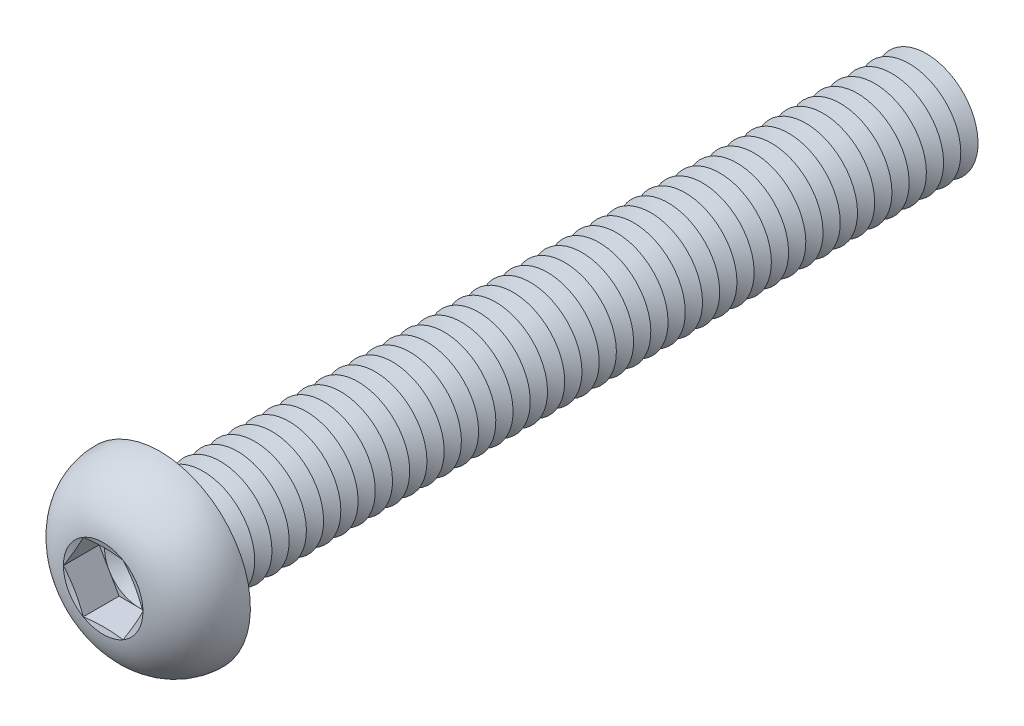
from build123d import *

# Parameters (mm, degrees)
FILLET1_R          = 0.5
LPATTERN1_COUNT    = 45
LPATTERN1_PITCH    = 1
CUT_EXTRUDE1_DEPTH = 2.08


with BuildPart() as part:
    # Sketch1 → Revolve1 (revolve)
    with BuildSketch(Plane(origin=(0, 0, 0), x_dir=(0, 0, -1), z_dir=(1, 0, 0))):
        with BuildLine():
            Line((0, 3), (0, 5.25))
            ThreePointArc((0, 5.25), (-2.210041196, 4.408189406), (-3.3, 2.3094))
            Line((-3.3, 2.3094), (-2.990599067, 1.1547))
            Line((-2.990599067, 1.1547), (-3.3, 1.1547))
            Line((-3.3, 1.1547), (-3.3, 0))
            Line((-3.3, 0), (45, 0))
            Line((45, 0), (45, 3))
            Line((45, 3), (0, 3))
        make_face()
    revolve(axis=Axis((0, 0, -45), (0, 0, 1)))

    # Fillet1
    fillet1_edges = [part.edges().sort_by_distance(p)[0] for p in [
        (0, -3, 0),
    ]]
    fillet(fillet1_edges, radius=FILLET1_R)

    # Sketch2 → Cut-Revolve1 (revolve, cut)
    with BuildSketch(Plane(origin=(0, 0, 0), x_dir=(0, 0, -1), z_dir=(1, 0, 0))):
        Polygon((44.5, 3), (45.5, 3), (45, 2.133974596), align=None)
    cut_revolve1 = revolve(axis=Axis((0, 0, -45), (0, 0, -1)), mode=Mode.SUBTRACT)

    # LPattern1: Cut-Revolve1 ×45
    with Locations(*[(0, 0, i * LPATTERN1_PITCH) for i in range(1, LPATTERN1_COUNT)]):
        add(cut_revolve1, mode=Mode.SUBTRACT)

    # Sketch3 → Cut-Extrude1 (cut)
    with BuildSketch(Plane.XY.offset(3.3)):
        Polygon((1.1547, 1.999999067), (-1.1547, 1.999999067), (-2.3094, 0), (-1.1547, -1.999999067), (1.1547, -1.999999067), (2.3094, 0), align=None)
    extrude(amount=-CUT_EXTRUDE1_DEPTH, mode=Mode.SUBTRACT)

    # Cut-Extrude2 cone 1 section (on through the dimple's axis) → Cut-Extrude2 (revolve, cut)
    with BuildSketch(Plane(origin=(0, 0, 1.22), x_dir=(0, -1, 0), z_dir=(1, 0, 0))):
        Polygon((0, 0), (1.999999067, 0), (0, 1.1547), align=None)
    revolve(axis=Axis((0, 0, 1.22), (0, 0, -1)), mode=Mode.SUBTRACT)


solid = part.part
